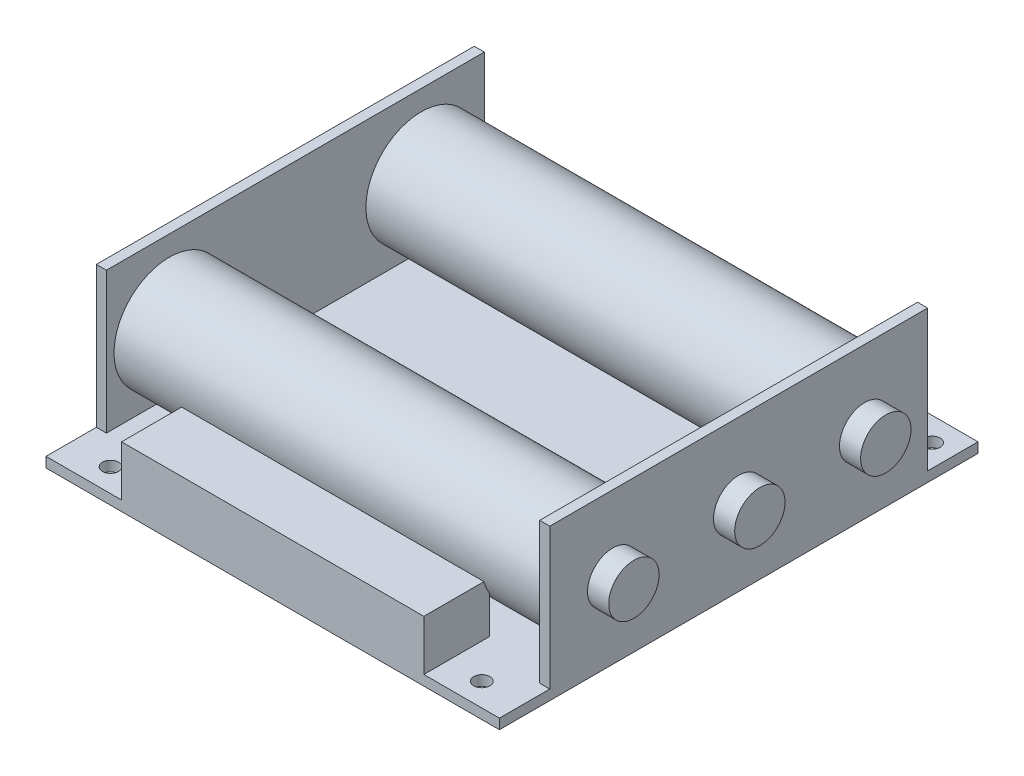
from build123d import *

# Parameters (mm, degrees)
SKETCH1_W                  = 90
SKETCH1_H                  = 95
BOSS_EXTRUDE1_DEPTH        = 2
F_3_2_3_2_DIAMETER_HOLE1_D = 3.2
SKETCH4_W                  = 75
SKETCH4_H                  = 30
BOSS_EXTRUDE2_DEPTH        = 2
BOSS_EXTRUDE3_DEPTH        = 4.2
BOSS_EXTRUDE3_DEPTH_BACK   = 94.2
SKETCH5_R                  = 5
SKETCH6_W                  = 60
SKETCH6_H                  = 13
BOSS_EXTRUDE4_DEPTH        = 10
SKETCH7_R                  = 5
BOSS_EXTRUDE5_DEPTH        = 4.2


with BuildPart() as part:
    # Sketch1 → Boss-Extrude1 (new body)
    with BuildSketch(Plane(origin=(0, 0, 0), x_dir=(1, 0, 0), z_dir=(0, 1, 0))):
        Rectangle(SKETCH1_W, SKETCH1_H)
    extrude(amount=BOSS_EXTRUDE1_DEPTH)

    # 3.2 _3.2_ Diameter Hole1 (through all)
    with Locations(Plane(origin=(0, 0, 0), x_dir=(-1, 0, 0), z_dir=(0, -1, 0))):
        with Locations((36.8, -42.9), (-36.9, -42.9), (-40.6, 42.8), (39.4, 42.8)):
            Hole(F_3_2_3_2_DIAMETER_HOLE1_D / 2)

    # Sketch4 → Boss-Extrude2 (add)
    with BuildSketch(Plane(origin=(45, 0, 0), x_dir=(0, 0, -1), z_dir=(1, 0, 0))):
        with Locations((0, 15)):
            Rectangle(SKETCH4_W, SKETCH4_H)
    boss_extrude2 = extrude(amount=-BOSS_EXTRUDE2_DEPTH)

    # Mirror1: Boss-Extrude2 across plane
    add(boss_extrude2.mirror(Plane(origin=(0, 0, 0), x_dir=(0, 0, 1), z_dir=(1, 0, 0))))

    # Sketch5 → Boss-Extrude3 (add, two sides: drawn at the far end of the back side and taken through both)
    with BuildSketch(Plane(origin=(45, 0, 0), x_dir=(0, 0, -1), z_dir=(1, 0, 0)).offset(-BOSS_EXTRUDE3_DEPTH_BACK)):
        with Locations((-25, 15)):
            Circle(SKETCH5_R)
        with Locations((25, 15)):
            Circle(SKETCH5_R)
    extrude(amount=BOSS_EXTRUDE3_DEPTH + BOSS_EXTRUDE3_DEPTH_BACK)

    # Sketch6 → Boss-Extrude4 (add)
    with BuildSketch(Plane(origin=(0, 2, 0), x_dir=(1, 0, 0), z_dir=(0, 1, 0))):
        with Locations((0, -41)):
            Rectangle(SKETCH6_W, SKETCH6_H)
    extrude(amount=BOSS_EXTRUDE4_DEPTH)

    # Sketch7 → Boss-Extrude5 (add)
    with BuildSketch(Plane.ZY.offset(45)):
        with Locations(Location((0, 15, 0), (0, 0, 180))):
            Circle(SKETCH7_R)
    boss_extrude5 = extrude(amount=BOSS_EXTRUDE5_DEPTH)

    # Mirror2: Boss-Extrude5 across plane
    add(boss_extrude5.mirror(Plane(origin=(0, 0, 0), x_dir=(0, 0, 1), z_dir=(1, 0, 0))))


solid = part.part
